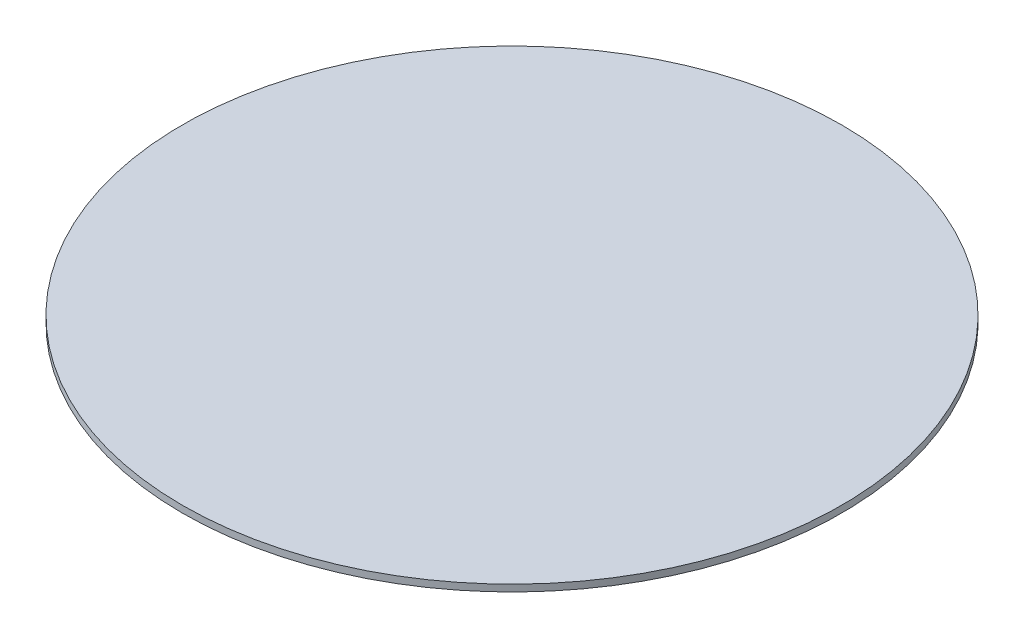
ISO-10303-21;
HEADER;
FILE_DESCRIPTION(('STEP AP214'),'2;1');
FILE_NAME('part.step','',(''),(''),'','','');
FILE_SCHEMA(('AUTOMOTIVE_DESIGN { 1 0 10303 214 1 1 1 1 }'));
ENDSEC;
DATA;
#1=APPLICATION_CONTEXT('core data for automotive mechanical design processes');
#2=APPLICATION_PROTOCOL_DEFINITION('international standard','automotive_design',2000,#1);
#3=PRODUCT_CONTEXT('',#1,'mechanical');
#4=PRODUCT('Part','Part','',(#3));
#5=PRODUCT_RELATED_PRODUCT_CATEGORY('part','',(#4));
#6=PRODUCT_DEFINITION_FORMATION('','',#4);
#7=PRODUCT_DEFINITION_CONTEXT('part definition',#1,'design');
#8=PRODUCT_DEFINITION('design','',#6,#7);
#9=PRODUCT_DEFINITION_SHAPE('','',#8);
#10=(LENGTH_UNIT() NAMED_UNIT(*) SI_UNIT(.MILLI.,.METRE.));
#11=(NAMED_UNIT(*) PLANE_ANGLE_UNIT() SI_UNIT($,.RADIAN.));
#12=(NAMED_UNIT(*) SI_UNIT($,.STERADIAN.) SOLID_ANGLE_UNIT());
#13=UNCERTAINTY_MEASURE_WITH_UNIT(LENGTH_MEASURE(1.E-05),#10,'distance_accuracy_value','');
#14=(GEOMETRIC_REPRESENTATION_CONTEXT(3) GLOBAL_UNCERTAINTY_ASSIGNED_CONTEXT((#13)) GLOBAL_UNIT_ASSIGNED_CONTEXT((#10,
#11,#12)) REPRESENTATION_CONTEXT('',''));
#15=CARTESIAN_POINT('',(0.,0.,0.));
#16=DIRECTION('',(0.,0.,1.));
#17=DIRECTION('',(1.,0.,0.));
#18=AXIS2_PLACEMENT_3D('',#15,#16,#17);
#19=CARTESIAN_POINT('',(0.,2.,0.));
#20=DIRECTION('',(0.,-1.,0.));
#21=DIRECTION('',(0.,0.,-1.));
#22=AXIS2_PLACEMENT_3D('',#19,#20,#21);
#23=CYLINDRICAL_SURFACE('',#22,97.);
#24=CARTESIAN_POINT('',(0.,2.,0.));
#25=DIRECTION('',(0.,1.,0.));
#26=DIRECTION('',(0.,0.,1.));
#27=AXIS2_PLACEMENT_3D('',#24,#25,#26);
#28=CIRCLE('',#27,97.);
#29=CARTESIAN_POINT('',(0.,2.,97.));
#30=VERTEX_POINT('',#29);
#31=EDGE_CURVE('E10',#30,#30,#28,.T.);
#32=ORIENTED_EDGE('',*,*,#31,.F.);
#33=EDGE_LOOP('',(#32));
#34=FACE_BOUND('',#33,.T.);
#35=CARTESIAN_POINT('',(0.,0.,0.));
#36=DIRECTION('',(0.,1.,0.));
#37=DIRECTION('',(0.,0.,1.));
#38=AXIS2_PLACEMENT_3D('',#35,#36,#37);
#39=CIRCLE('',#38,97.);
#40=CARTESIAN_POINT('',(0.,0.,97.));
#41=VERTEX_POINT('',#40);
#42=EDGE_CURVE('E40',#41,#41,#39,.T.);
#43=ORIENTED_EDGE('',*,*,#42,.T.);
#44=EDGE_LOOP('',(#43));
#45=FACE_BOUND('',#44,.T.);
#46=ADVANCED_FACE('F37',(#34,#45),#23,.T.);
#47=CARTESIAN_POINT('',(0.,2.,0.));
#48=DIRECTION('',(0.,1.,0.));
#49=DIRECTION('',(0.,0.,1.));
#50=AXIS2_PLACEMENT_3D('',#47,#48,#49);
#51=PLANE('',#50);
#52=ORIENTED_EDGE('',*,*,#31,.T.);
#53=EDGE_LOOP('',(#52));
#54=FACE_BOUND('',#53,.T.);
#55=ADVANCED_FACE('F54',(#54),#51,.T.);
#56=CARTESIAN_POINT('',(0.,0.,0.));
#57=DIRECTION('',(0.,1.,0.));
#58=DIRECTION('',(0.,0.,1.));
#59=AXIS2_PLACEMENT_3D('',#56,#57,#58);
#60=PLANE('',#59);
#61=ORIENTED_EDGE('',*,*,#42,.F.);
#62=EDGE_LOOP('',(#61));
#63=FACE_BOUND('',#62,.T.);
#64=ADVANCED_FACE('F52',(#63),#60,.F.);
#65=CLOSED_SHELL('',(#46,#55,#64));
#66=MANIFOLD_SOLID_BREP('B2',#65);
#67=ADVANCED_BREP_SHAPE_REPRESENTATION('',(#18,#66),#14);
#68=SHAPE_DEFINITION_REPRESENTATION(#9,#67);
ENDSEC;
END-ISO-10303-21;
